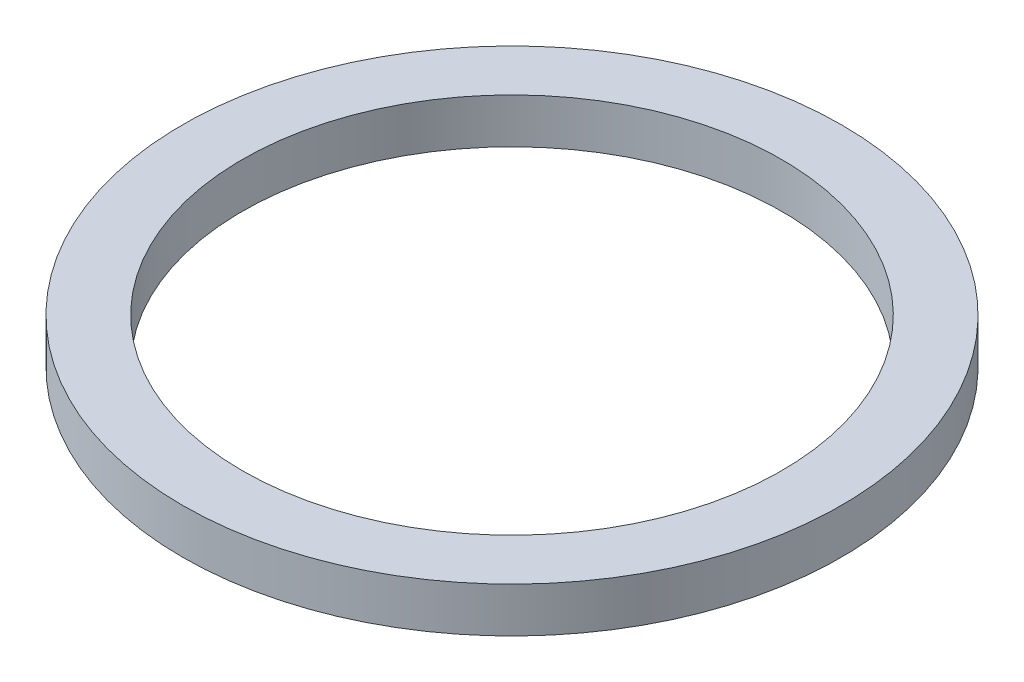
from build123d import *

# Parameters (mm, degrees)
SKETCH1_R           = 11000
SKETCH1_R_2         = 9000
BOSS_EXTRUDE1_DEPTH = 1500


with BuildPart() as part:
    # Sketch1 → Boss-Extrude1 (new body)
    with BuildSketch(Plane(origin=(0, 0, 0), x_dir=(1, 0, 0), z_dir=(0, 1, 0))):
        with Locations(Location((0, 0, 0), (0, 0, 270))):
            Circle(SKETCH1_R)
        with Locations(Location((0, 0, 0), (0, 0, 270))):
            Circle(SKETCH1_R_2, mode=Mode.SUBTRACT)
    extrude(amount=BOSS_EXTRUDE1_DEPTH)


solid = part.part
